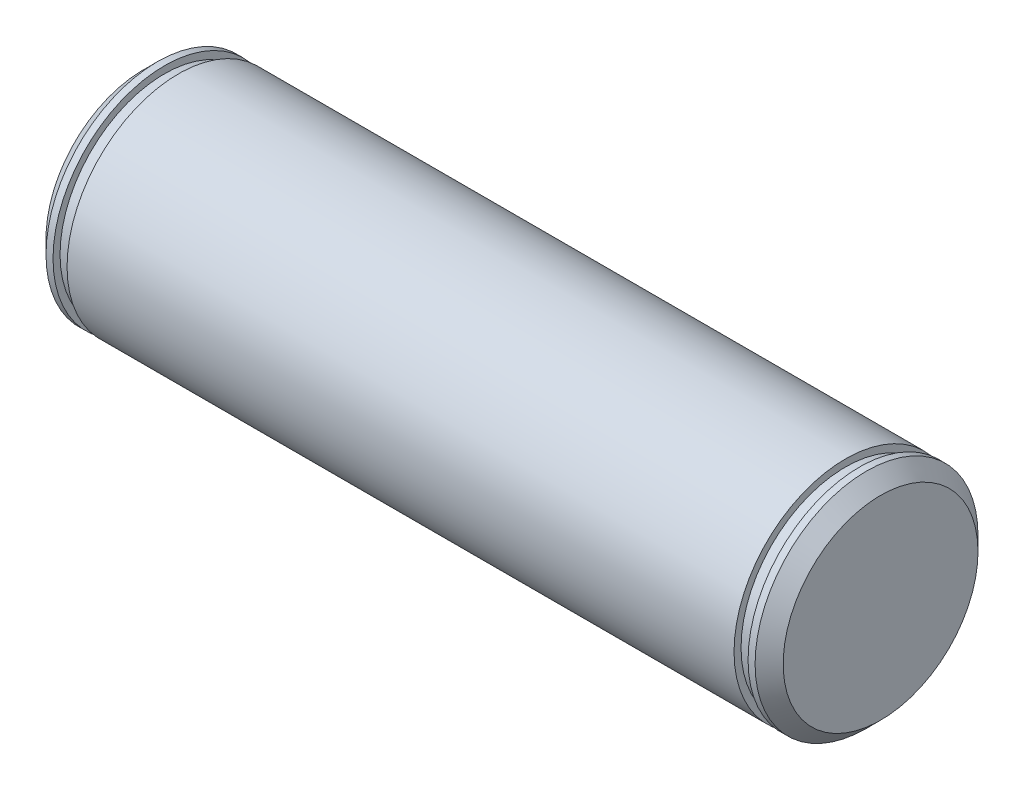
from build123d import *

# Parameters (mm, degrees)
SKETCH1_R           = 15.875
BOSS_EXTRUDE1_DEPTH = 52.5
CHAMFER1_SIZE       = 2
SKETCH2_R           = 15.875
SKETCH2_R_2         = 14.875
CUT_EXTRUDE1_DEPTH  = 2


with BuildPart() as part:
    # Sketch1 → Boss-Extrude1 (new, symmetric)
    with BuildSketch(Plane(origin=(0, 0, 0), x_dir=(0, 0, -1), z_dir=(1, 0, 0))):
        Circle(SKETCH1_R)
    extrude(amount=BOSS_EXTRUDE1_DEPTH, both=True)

    # Chamfer1
    chamfer1_edges = [part.edges().sort_by_distance(p)[0] for p in [
        (-52.5, 0, 15.875),
        (52.5, 0, 15.875),
    ]]
    chamfer(chamfer1_edges, length=CHAMFER1_SIZE)

    # Sketch2 → Cut-Extrude1 (cut)
    with BuildSketch(Plane.ZY.offset(47.5)):
        Circle(SKETCH2_R)
        Circle(SKETCH2_R_2, mode=Mode.SUBTRACT)
    cut_extrude1 = extrude(amount=CUT_EXTRUDE1_DEPTH, mode=Mode.SUBTRACT)

    # Mirror1: Cut-Extrude1 across plane
    add(cut_extrude1.mirror(Plane(origin=(0, 0, 0), x_dir=(0, 0, 1), z_dir=(1, 0, 0))), mode=Mode.SUBTRACT)


solid = part.part
